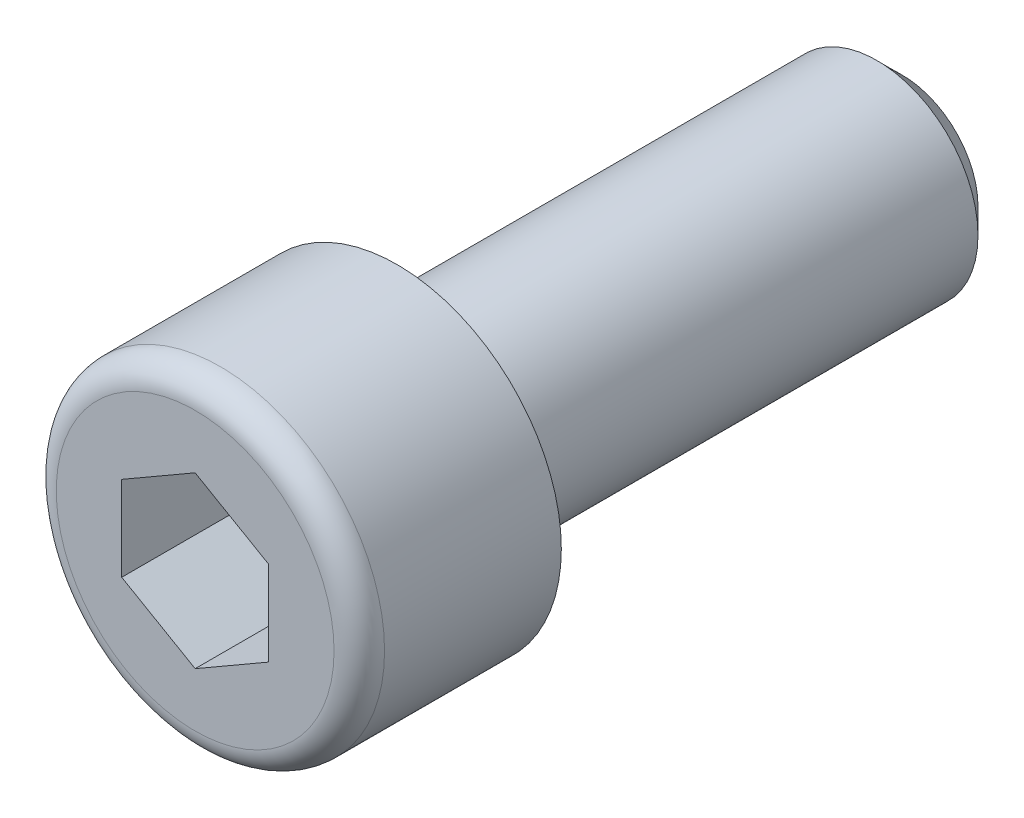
from build123d import *

# Parameters (mm, degrees)
ESQUISSE1_R             = 4
BOSS_EXTRU_1_DEPTH      = 20
ESQUISSE2_R             = 6.5
BOSS_EXTRU_2_DEPTH      = 8
CONG_1_R                = 1
CHANFREIN1_SIZE         = 1
ENL_V_MAT_EXTRU_1_DEPTH = 5


with BuildPart() as part:
    # Esquisse1 → Boss.-Extru.1 (new body)
    with BuildSketch(Plane.XY):
        with Locations((-326.297546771, 10)):
            Circle(ESQUISSE1_R)
    extrude(amount=-BOSS_EXTRU_1_DEPTH)

    # Esquisse2 → Boss.-Extru.2 (add)
    with BuildSketch(Plane.XY):
        with Locations((-326.297546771, 10)):
            Circle(ESQUISSE2_R)
    extrude(amount=BOSS_EXTRU_2_DEPTH)

    # Cong_1
    cong_1_edges = [part.edges().sort_by_distance(p)[0] for p in [
        (-332.797546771, 10, 8),
    ]]
    fillet(cong_1_edges, radius=CONG_1_R)

    # Chanfrein1
    chanfrein1_edges = [part.edges().sort_by_distance(p)[0] for p in [
        (-330.297546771, 10, -20),
    ]]
    chamfer(chanfrein1_edges, length=CHANFREIN1_SIZE)

    # Esquisse3 → Enl_v. mat.-Extru.1 (cut)
    with BuildSketch(Plane.XY.offset(8)):
        Polygon((-326.297546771, 13.358158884), (-329.205797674, 11.679079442), (-329.205797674, 8.320920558), (-326.297546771, 6.641841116), (-323.389295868, 8.320920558), (-323.389295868, 11.679079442), align=None)
    extrude(amount=-ENL_V_MAT_EXTRU_1_DEPTH, mode=Mode.SUBTRACT)


solid = part.part
